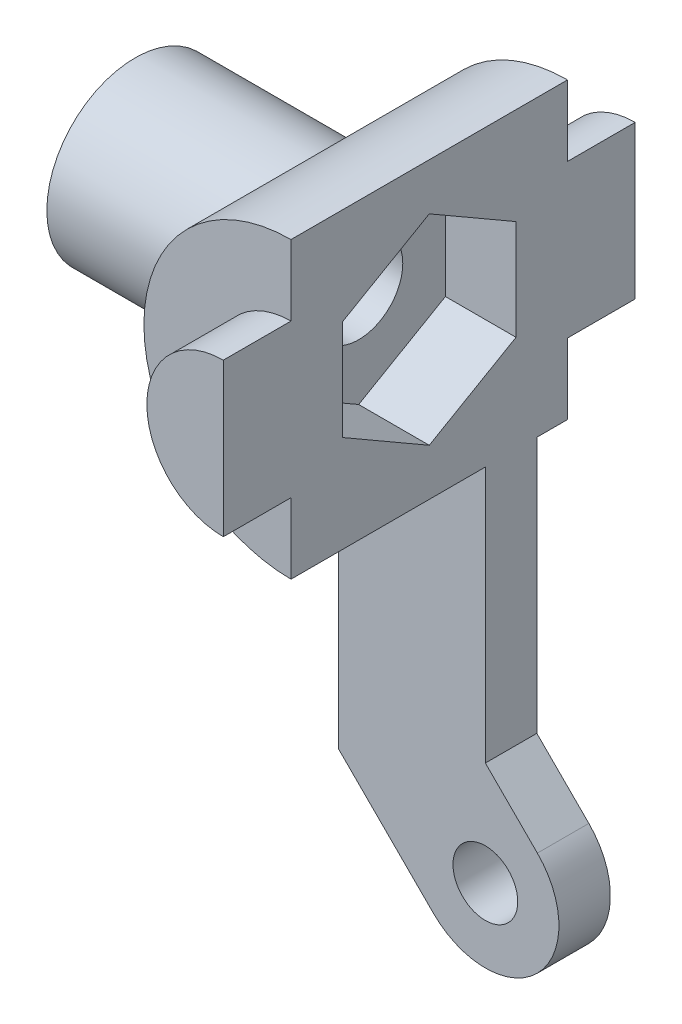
ISO-10303-21;
HEADER;
FILE_DESCRIPTION(('STEP AP214'),'2;1');
FILE_NAME('part.step','',(''),(''),'','','');
FILE_SCHEMA(('AUTOMOTIVE_DESIGN { 1 0 10303 214 1 1 1 1 }'));
ENDSEC;
DATA;
#1=APPLICATION_CONTEXT('core data for automotive mechanical design processes');
#2=APPLICATION_PROTOCOL_DEFINITION('international standard','automotive_design',2000,#1);
#3=PRODUCT_CONTEXT('',#1,'mechanical');
#4=PRODUCT('Part','Part','',(#3));
#5=PRODUCT_RELATED_PRODUCT_CATEGORY('part','',(#4));
#6=PRODUCT_DEFINITION_FORMATION('','',#4);
#7=PRODUCT_DEFINITION_CONTEXT('part definition',#1,'design');
#8=PRODUCT_DEFINITION('design','',#6,#7);
#9=PRODUCT_DEFINITION_SHAPE('','',#8);
#10=(LENGTH_UNIT() NAMED_UNIT(*) SI_UNIT(.MILLI.,.METRE.));
#11=(NAMED_UNIT(*) PLANE_ANGLE_UNIT() SI_UNIT($,.RADIAN.));
#12=(NAMED_UNIT(*) SI_UNIT($,.STERADIAN.) SOLID_ANGLE_UNIT());
#13=UNCERTAINTY_MEASURE_WITH_UNIT(LENGTH_MEASURE(1.E-05),#10,'distance_accuracy_value','');
#14=(GEOMETRIC_REPRESENTATION_CONTEXT(3) GLOBAL_UNCERTAINTY_ASSIGNED_CONTEXT((#13)) GLOBAL_UNIT_ASSIGNED_CONTEXT((#10,
#11,#12)) REPRESENTATION_CONTEXT('',''));
#15=CARTESIAN_POINT('',(0.,0.,0.));
#16=DIRECTION('',(0.,0.,1.));
#17=DIRECTION('',(1.,0.,0.));
#18=AXIS2_PLACEMENT_3D('',#15,#16,#17);
#19=CARTESIAN_POINT('',(-28.5875999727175,51.1546126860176,-10.));
#20=DIRECTION('',(0.,0.,1.));
#21=DIRECTION('',(-1.,0.,0.));
#22=AXIS2_PLACEMENT_3D('',#19,#20,#21);
#23=CYLINDRICAL_SURFACE('',#22,5.);
#24=CARTESIAN_POINT('',(-28.5875999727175,51.1546126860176,-9.7));
#25=DIRECTION('',(0.,0.,1.));
#26=DIRECTION('',(1.,0.,0.));
#27=AXIS2_PLACEMENT_3D('',#24,#25,#26);
#28=CIRCLE('',#27,5.);
#29=CARTESIAN_POINT('',(-28.5875999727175,56.1546126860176,-9.7));
#30=VERTEX_POINT('',#29);
#31=CARTESIAN_POINT('',(-28.5875999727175,46.1546126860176,-9.7));
#32=VERTEX_POINT('',#31);
#33=EDGE_CURVE('E204',#30,#32,#28,.T.);
#34=ORIENTED_EDGE('',*,*,#33,.T.);
#35=DIRECTION('',(0.,0.,1.));
#36=VECTOR('',#35,1.);
#37=CARTESIAN_POINT('',(-28.5875999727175,46.1546126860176,-10.));
#38=LINE('',#37,#36);
#39=CARTESIAN_POINT('',(-28.5875999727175,46.1546126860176,-8.65757331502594));
#40=VERTEX_POINT('',#39);
#41=EDGE_CURVE('E192',#32,#40,#38,.T.);
#42=ORIENTED_EDGE('',*,*,#41,.T.);
#43=CARTESIAN_POINT('',(-28.5875999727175,51.1546126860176,-8.65757331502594));
#44=DIRECTION('',(0.,0.,1.));
#45=DIRECTION('',(1.,0.,0.));
#46=AXIS2_PLACEMENT_3D('',#43,#44,#45);
#47=CIRCLE('',#46,5.);
#48=CARTESIAN_POINT('',(-33.5875999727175,51.1546126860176,-8.65757331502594));
#49=VERTEX_POINT('',#48);
#50=EDGE_CURVE('E224',#40,#49,#47,.F.);
#51=ORIENTED_EDGE('',*,*,#50,.T.);
#52=DIRECTION('',(0.,0.,1.));
#53=VECTOR('',#52,1.);
#54=CARTESIAN_POINT('',(-33.5875999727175,51.1546126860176,-32.3990574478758));
#55=LINE('',#54,#53);
#56=CARTESIAN_POINT('',(-33.5875999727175,51.1546126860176,-8.));
#57=VERTEX_POINT('',#56);
#58=EDGE_CURVE('E229',#49,#57,#55,.T.);
#59=ORIENTED_EDGE('',*,*,#58,.T.);
#60=CARTESIAN_POINT('',(-33.5875999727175,51.1546126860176,-2.));
#61=CARTESIAN_POINT('',(-33.5875990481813,51.2313824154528,-2.00000105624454));
#62=CARTESIAN_POINT('',(-33.5858256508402,51.308174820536,-2.00295359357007));
#63=CARTESIAN_POINT('',(-33.5787835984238,51.4611611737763,-2.01471423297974));
#64=CARTESIAN_POINT('',(-33.573512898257,51.5373547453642,-2.02352576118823));
#65=CARTESIAN_POINT('',(-33.5525934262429,51.7644208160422,-2.05864855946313));
#66=CARTESIAN_POINT('',(-33.5318376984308,51.9135945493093,-2.09364770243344));
#67=CARTESIAN_POINT('',(-33.4788323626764,52.2021543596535,-2.18477274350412));
#68=CARTESIAN_POINT('',(-33.4466397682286,52.341584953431,-2.24079392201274));
#69=CARTESIAN_POINT('',(-33.3735069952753,52.6086631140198,-2.37172066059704));
#70=CARTESIAN_POINT('',(-33.3325689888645,52.7363135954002,-2.44662153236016));
#71=CARTESIAN_POINT('',(-33.2417072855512,52.9872142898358,-2.61954965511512));
#72=CARTESIAN_POINT('',(-33.1913358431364,53.1093815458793,-2.71890739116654));
#73=CARTESIAN_POINT('',(-33.0882087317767,53.3363772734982,-2.93493440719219));
#74=CARTESIAN_POINT('',(-33.0354500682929,53.4411831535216,-3.05162587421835));
#75=CARTESIAN_POINT('',(-32.9258213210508,53.643512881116,-3.31584702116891));
#76=CARTESIAN_POINT('',(-32.8692403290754,53.738568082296,-3.46540354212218));
#77=CARTESIAN_POINT('',(-32.7663659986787,53.9018413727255,-3.78169314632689));
#78=CARTESIAN_POINT('',(-32.7200560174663,53.9701030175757,-3.94839779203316));
#79=CARTESIAN_POINT('',(-32.6546925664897,54.0634247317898,-4.2531929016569));
#80=CARTESIAN_POINT('',(-32.6317576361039,54.094936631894,-4.38847199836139));
#81=CARTESIAN_POINT('',(-32.5994061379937,54.1389361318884,-4.66360743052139));
#82=CARTESIAN_POINT('',(-32.5899727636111,54.1514473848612,-4.80345785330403));
#83=CARTESIAN_POINT('',(-32.58601842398,54.1567228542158,-5.08402299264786));
#84=CARTESIAN_POINT('',(-32.5915267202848,54.1494483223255,-5.22473886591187));
#85=CARTESIAN_POINT('',(-32.6166651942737,54.1155339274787,-5.50255753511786));
#86=CARTESIAN_POINT('',(-32.6363059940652,54.088879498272,-5.63965753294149));
#87=CARTESIAN_POINT('',(-32.6866637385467,54.0180910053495,-5.90506054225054));
#88=CARTESIAN_POINT('',(-32.7172343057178,53.9741872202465,-6.03345432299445));
#89=CARTESIAN_POINT('',(-32.7861408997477,53.8705143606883,-6.2813897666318));
#90=CARTESIAN_POINT('',(-32.8244797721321,53.8107394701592,-6.40092816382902));
#91=CARTESIAN_POINT('',(-32.9127069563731,53.6649704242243,-6.64996913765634));
#92=CARTESIAN_POINT('',(-32.963442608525,53.5762194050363,-6.77755999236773));
#93=CARTESIAN_POINT('',(-33.066210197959,53.3804423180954,-7.01734915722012));
#94=CARTESIAN_POINT('',(-33.118243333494,53.2733987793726,-7.12953256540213));
#95=CARTESIAN_POINT('',(-33.2263176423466,53.0262030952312,-7.35124225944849));
#96=CARTESIAN_POINT('',(-33.2819067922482,52.8835158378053,-7.45821939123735));
#97=CARTESIAN_POINT('',(-33.3577832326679,52.6552232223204,-7.59926871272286));
#98=CARTESIAN_POINT('',(-33.3818331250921,52.5767109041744,-7.6430641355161));
#99=CARTESIAN_POINT('',(-33.4267649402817,52.4153563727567,-7.723718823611));
#100=CARTESIAN_POINT('',(-33.4476488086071,52.3325168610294,-7.7605823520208));
#101=CARTESIAN_POINT('',(-33.4844267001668,52.1683763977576,-7.82481144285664));
#102=CARTESIAN_POINT('',(-33.500550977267,52.0873027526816,-7.85262656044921));
#103=CARTESIAN_POINT('',(-33.5289912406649,51.9224926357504,-7.90133395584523));
#104=CARTESIAN_POINT('',(-33.5413093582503,51.8387576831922,-7.92223010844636));
#105=CARTESIAN_POINT('',(-33.5617636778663,51.669357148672,-7.95677185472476));
#106=CARTESIAN_POINT('',(-33.5699029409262,51.5836930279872,-7.97042275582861));
#107=CARTESIAN_POINT('',(-33.5817599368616,51.4112344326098,-7.99026618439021));
#108=CARTESIAN_POINT('',(-33.5854782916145,51.3244401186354,-7.99645976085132));
#109=CARTESIAN_POINT('',(-33.5893915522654,51.087288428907,-8.00299267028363));
#110=CARTESIAN_POINT('',(-33.5850650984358,50.9365558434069,-7.9958115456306));
#111=CARTESIAN_POINT('',(-33.5631795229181,50.6389257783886,-7.9591544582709));
#112=CARTESIAN_POINT('',(-33.5456206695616,50.4920282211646,-7.92967894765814));
#113=CARTESIAN_POINT('',(-33.4994944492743,50.2094700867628,-7.85091154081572));
#114=CARTESIAN_POINT('',(-33.4712051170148,50.0736231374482,-7.80211887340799));
#115=CARTESIAN_POINT('',(-33.4058779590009,49.8120792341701,-7.6866456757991));
#116=CARTESIAN_POINT('',(-33.3688384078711,49.6863842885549,-7.61996161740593));
#117=CARTESIAN_POINT('',(-33.2845097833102,49.4346007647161,-7.46288590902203));
#118=CARTESIAN_POINT('',(-33.236555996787,49.3098245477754,-7.37075230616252));
#119=CARTESIAN_POINT('',(-33.1370853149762,49.0765604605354,-7.16921724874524));
#120=CARTESIAN_POINT('',(-33.0855643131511,48.968091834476,-7.05979570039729));
#121=CARTESIAN_POINT('',(-32.9765084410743,48.755972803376,-6.81017920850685));
#122=CARTESIAN_POINT('',(-32.919064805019,48.6547923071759,-6.66783222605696));
#123=CARTESIAN_POINT('',(-32.8119236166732,48.4777078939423,-6.36556795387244));
#124=CARTESIAN_POINT('',(-32.7622179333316,48.401777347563,-6.20566941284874));
#125=CARTESIAN_POINT('',(-32.6872981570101,48.2917611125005,-5.90751395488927));
#126=CARTESIAN_POINT('',(-32.6591131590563,48.2521801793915,-5.77203937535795));
#127=CARTESIAN_POINT('',(-32.6157920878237,48.1923394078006,-5.49493584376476));
#128=CARTESIAN_POINT('',(-32.6006379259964,48.1720527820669,-5.35331571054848));
#129=CARTESIAN_POINT('',(-32.5856089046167,48.1519300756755,-5.06724610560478));
#130=CARTESIAN_POINT('',(-32.5857915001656,48.1521708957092,-4.9227880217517));
#131=CARTESIAN_POINT('',(-32.6015543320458,48.1732832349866,-4.6362111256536));
#132=CARTESIAN_POINT('',(-32.6171429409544,48.1941659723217,-4.49409362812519));
#133=CARTESIAN_POINT('',(-32.6602636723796,48.2538091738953,-4.2230231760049));
#134=CARTESIAN_POINT('',(-32.6871841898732,48.2916598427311,-4.09376585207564));
#135=CARTESIAN_POINT('',(-32.7497100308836,48.3833479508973,-3.84332545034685));
#136=CARTESIAN_POINT('',(-32.7853186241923,48.4371914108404,-3.72214543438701));
#137=CARTESIAN_POINT('',(-32.8678597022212,48.5688273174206,-3.47136046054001));
#138=CARTESIAN_POINT('',(-32.9156913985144,48.6490275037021,-3.34331849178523));
#139=CARTESIAN_POINT('',(-33.014002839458,48.827100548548,-3.10123915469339));
#140=CARTESIAN_POINT('',(-33.0644847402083,48.9249879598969,-2.98721344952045));
#141=CARTESIAN_POINT('',(-33.1721123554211,49.1544091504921,-2.75730115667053));
#142=CARTESIAN_POINT('',(-33.2290004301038,49.2888269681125,-2.64415012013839));
#143=CARTESIAN_POINT('',(-33.334914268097,49.5777199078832,-2.44179201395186));
#144=CARTESIAN_POINT('',(-33.3839372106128,49.7322021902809,-2.35259352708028));
#145=CARTESIAN_POINT('',(-33.4468055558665,49.9735907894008,-2.24087552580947));
#146=CARTESIAN_POINT('',(-33.4657713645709,50.0543625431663,-2.2076640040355));
#147=CARTESIAN_POINT('',(-33.5000341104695,50.2191704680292,-2.14822786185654));
#148=CARTESIAN_POINT('',(-33.5153331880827,50.3032047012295,-2.12199916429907));
#149=CARTESIAN_POINT('',(-33.5417552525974,50.473610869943,-2.07699055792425));
#150=CARTESIAN_POINT('',(-33.552890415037,50.5599751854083,-2.05818892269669));
#151=CARTESIAN_POINT('',(-33.57068315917,50.7344289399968,-2.02825564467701));
#152=CARTESIAN_POINT('',(-33.5773444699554,50.8225168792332,-2.01711761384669));
#153=CARTESIAN_POINT('',(-33.5836372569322,50.9514887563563,-2.00660831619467));
#154=CARTESIAN_POINT('',(-33.5851219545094,50.9920564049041,-2.004131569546));
#155=CARTESIAN_POINT('',(-33.5871035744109,51.0732848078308,-2.00082710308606));
#156=CARTESIAN_POINT('',(-33.5876004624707,51.1139455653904,-1.99999944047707));
#157=CARTESIAN_POINT('',(-33.5875999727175,51.1546126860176,-2.));
#158=B_SPLINE_CURVE_WITH_KNOTS('',3,(#60,#61,#62,#63,#64,#65,#66,#67,#68,#69,#70,#71,#72,#73,
#74,#75,#76,#77,#78,#79,#80,#81,#82,#83,#84,#85,#86,#87,#88,#89,#90,#91,#92,#93,#94,#95,#96,#97,
#98,#99,#100,#101,#102,#103,#104,#105,#106,#107,#108,#109,#110,#111,#112,#113,#114,#115,#116,
#117,#118,#119,#120,#121,#122,#123,#124,#125,#126,#127,#128,#129,#130,#131,#132,#133,#134,#135,
#136,#137,#138,#139,#140,#141,#142,#143,#144,#145,#146,#147,#148,#149,#150,#151,#152,#153,#154,
#155,#156,#157),.UNSPECIFIED.,.T.,.F.,(4,2,2,2,2,2,2,2,2,2,2,2,2,2,2,2,2,2,2,2,2,2,2,2,2,2,2,2,
2,2,2,2,2,2,2,2,2,2,2,2,2,2,2,2,2,2,2,2,4),(0.,0.230263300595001,0.460661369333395,
0.922002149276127,1.38107466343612,1.84003329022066,2.33408870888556,2.82878205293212,
3.38413315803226,3.93857770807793,4.35913349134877,4.77916531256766,5.20002031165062,
5.62119195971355,6.03692224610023,6.45280509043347,6.94139679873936,7.43045779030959,
7.98767605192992,8.26653157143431,8.54521503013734,8.80648473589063,9.06760787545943,
9.3285394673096,9.58943435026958,10.0398406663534,10.490237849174,10.9296843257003,
11.3692175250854,11.8543559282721,12.3400624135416,12.889063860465,13.437484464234,
13.8674843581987,14.2968863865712,14.7278971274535,15.1591422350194,15.5696105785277,
15.9802336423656,16.4539008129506,16.927959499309,17.4794148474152,18.0310675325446,
18.2988384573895,18.5664526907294,18.8332781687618,19.0998809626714,19.221853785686,
19.3438308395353),.UNSPECIFIED.);
#159=CARTESIAN_POINT('',(-33.0191726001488,48.8391939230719,-6.90757331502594));
#160=VERTEX_POINT('',#159);
#161=EDGE_CURVE('E181',#160,#57,#158,.T.);
#162=ORIENTED_EDGE('',*,*,#161,.F.);
#163=CARTESIAN_POINT('',(-28.5875999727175,51.1546126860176,-6.90757331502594));
#164=DIRECTION('',(0.,0.,-1.));
#165=DIRECTION('',(-1.,0.,0.));
#166=AXIS2_PLACEMENT_3D('',#163,#164,#165);
#167=CIRCLE('',#166,5.);
#168=CARTESIAN_POINT('',(-28.5875999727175,46.1546126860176,-6.90757331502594));
#169=VERTEX_POINT('',#168);
#170=EDGE_CURVE('E262',#169,#160,#167,.T.);
#171=ORIENTED_EDGE('',*,*,#170,.F.);
#172=CARTESIAN_POINT('',(-28.5875999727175,46.1546126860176,-0.3));
#173=VERTEX_POINT('',#172);
#174=EDGE_CURVE('E183',#169,#173,#38,.T.);
#175=ORIENTED_EDGE('',*,*,#174,.T.);
#176=CARTESIAN_POINT('',(-28.5875999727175,51.1546126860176,-0.3));
#177=DIRECTION('',(0.,0.,1.));
#178=DIRECTION('',(1.,0.,0.));
#179=AXIS2_PLACEMENT_3D('',#176,#177,#178);
#180=CIRCLE('',#179,5.);
#181=CARTESIAN_POINT('',(-28.5875999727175,56.1546126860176,-0.3));
#182=VERTEX_POINT('',#181);
#183=EDGE_CURVE('E278',#182,#173,#180,.T.);
#184=ORIENTED_EDGE('',*,*,#183,.F.);
#185=DIRECTION('',(0.,0.,1.));
#186=VECTOR('',#185,1.);
#187=CARTESIAN_POINT('',(-28.5875999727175,56.1546126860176,-10.));
#188=LINE('',#187,#186);
#189=EDGE_CURVE('E180',#30,#182,#188,.T.);
#190=ORIENTED_EDGE('',*,*,#189,.F.);
#191=EDGE_LOOP('',(#34,#42,#51,#59,#162,#171,#175,#184,#190));
#192=FACE_BOUND('',#191,.T.);
#193=ADVANCED_FACE('F33',(#192),#23,.T.);
#194=CARTESIAN_POINT('',(-28.5875999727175,56.1546126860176,-10.));
#195=DIRECTION('',(-1.,0.,0.));
#196=DIRECTION('',(0.,0.,-1.));
#197=AXIS2_PLACEMENT_3D('',#194,#195,#196);
#198=PLANE('',#197);
#199=DIRECTION('',(0.,0.500000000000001,-0.866025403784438));
#200=VECTOR('',#199,1.);
#201=CARTESIAN_POINT('',(-28.5875999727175,47.7482460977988,-5.));
#202=LINE('',#201,#200);
#203=CARTESIAN_POINT('',(-28.5875999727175,47.7482460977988,-5.));
#204=VERTEX_POINT('',#203);
#205=CARTESIAN_POINT('',(-28.5875999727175,49.4514293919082,-7.95000000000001));
#206=VERTEX_POINT('',#205);
#207=EDGE_CURVE('E297',#204,#206,#202,.T.);
#208=ORIENTED_EDGE('',*,*,#207,.F.);
#209=DIRECTION('',(0.,-0.500000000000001,-0.866025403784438));
#210=VECTOR('',#209,1.);
#211=CARTESIAN_POINT('',(-28.5875999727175,49.4514293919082,-2.05));
#212=LINE('',#211,#210);
#213=CARTESIAN_POINT('',(-28.5875999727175,49.4514293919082,-2.05));
#214=VERTEX_POINT('',#213);
#215=EDGE_CURVE('E300',#214,#204,#212,.T.);
#216=ORIENTED_EDGE('',*,*,#215,.F.);
#217=DIRECTION('',(0.,-1.,0.));
#218=VECTOR('',#217,1.);
#219=CARTESIAN_POINT('',(-28.5875999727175,52.857795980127,-2.05));
#220=LINE('',#219,#218);
#221=CARTESIAN_POINT('',(-28.5875999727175,52.857795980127,-2.05));
#222=VERTEX_POINT('',#221);
#223=EDGE_CURVE('E287',#222,#214,#220,.T.);
#224=ORIENTED_EDGE('',*,*,#223,.F.);
#225=DIRECTION('',(0.,-0.500000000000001,0.866025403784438));
#226=VECTOR('',#225,1.);
#227=CARTESIAN_POINT('',(-28.5875999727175,54.5609792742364,-5.));
#228=LINE('',#227,#226);
#229=CARTESIAN_POINT('',(-28.5875999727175,54.5609792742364,-5.));
#230=VERTEX_POINT('',#229);
#231=EDGE_CURVE('E288',#230,#222,#228,.T.);
#232=ORIENTED_EDGE('',*,*,#231,.F.);
#233=DIRECTION('',(0.,0.500000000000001,0.866025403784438));
#234=VECTOR('',#233,1.);
#235=CARTESIAN_POINT('',(-28.5875999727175,52.857795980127,-7.95000000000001));
#236=LINE('',#235,#234);
#237=CARTESIAN_POINT('',(-28.5875999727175,52.857795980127,-7.95000000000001));
#238=VERTEX_POINT('',#237);
#239=EDGE_CURVE('E291',#238,#230,#236,.T.);
#240=ORIENTED_EDGE('',*,*,#239,.F.);
#241=DIRECTION('',(0.,1.,0.));
#242=VECTOR('',#241,1.);
#243=CARTESIAN_POINT('',(-28.5875999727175,49.4514293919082,-7.95000000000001));
#244=LINE('',#243,#242);
#245=EDGE_CURVE('E294',#206,#238,#244,.T.);
#246=ORIENTED_EDGE('',*,*,#245,.F.);
#247=EDGE_LOOP('',(#208,#216,#224,#232,#240,#246));
#248=FACE_BOUND('',#247,.T.);
#249=DIRECTION('',(0.,0.,1.));
#250=VECTOR('',#249,1.);
#251=CARTESIAN_POINT('',(-28.5875999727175,53.7546126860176,4.5503620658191));
#252=LINE('',#251,#250);
#253=CARTESIAN_POINT('',(-28.5875999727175,53.7546126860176,-9.7));
#254=VERTEX_POINT('',#253);
#255=CARTESIAN_POINT('',(-28.5875999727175,53.7546126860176,-12.));
#256=VERTEX_POINT('',#255);
#257=EDGE_CURVE('E48',#254,#256,#252,.F.);
#258=ORIENTED_EDGE('',*,*,#257,.F.);
#259=DIRECTION('',(0.,-1.,0.));
#260=VECTOR('',#259,1.);
#261=CARTESIAN_POINT('',(-28.5875999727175,56.1546126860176,-9.7));
#262=LINE('',#261,#260);
#263=EDGE_CURVE('E11',#30,#254,#262,.T.);
#264=ORIENTED_EDGE('',*,*,#263,.F.);
#265=ORIENTED_EDGE('',*,*,#189,.T.);
#266=DIRECTION('',(0.,1.,0.));
#267=VECTOR('',#266,1.);
#268=CARTESIAN_POINT('',(-28.5875999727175,56.1546126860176,-0.3));
#269=LINE('',#268,#267);
#270=CARTESIAN_POINT('',(-28.5875999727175,53.7546126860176,-0.3));
#271=VERTEX_POINT('',#270);
#272=EDGE_CURVE('E193',#271,#182,#269,.T.);
#273=ORIENTED_EDGE('',*,*,#272,.F.);
#274=DIRECTION('',(0.,0.,1.));
#275=VECTOR('',#274,1.);
#276=CARTESIAN_POINT('',(-28.5875999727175,53.7546126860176,4.5503620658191));
#277=LINE('',#276,#275);
#278=CARTESIAN_POINT('',(-28.5875999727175,53.7546126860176,2.));
#279=VERTEX_POINT('',#278);
#280=EDGE_CURVE('E279',#279,#271,#277,.F.);
#281=ORIENTED_EDGE('',*,*,#280,.F.);
#282=DIRECTION('',(0.,-1.,0.));
#283=VECTOR('',#282,1.);
#284=CARTESIAN_POINT('',(-28.5875999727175,54.1546126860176,2.));
#285=LINE('',#284,#283);
#286=CARTESIAN_POINT('',(-28.5875999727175,48.5546126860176,2.));
#287=VERTEX_POINT('',#286);
#288=EDGE_CURVE('E336',#279,#287,#285,.T.);
#289=ORIENTED_EDGE('',*,*,#288,.T.);
#290=DIRECTION('',(0.,0.,1.));
#291=VECTOR('',#290,1.);
#292=CARTESIAN_POINT('',(-28.5875999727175,48.5546126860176,4.5503620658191));
#293=LINE('',#292,#291);
#294=CARTESIAN_POINT('',(-28.5875999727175,48.5546126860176,-0.3));
#295=VERTEX_POINT('',#294);
#296=EDGE_CURVE('E56',#295,#287,#293,.T.);
#297=ORIENTED_EDGE('',*,*,#296,.F.);
#298=EDGE_CURVE('E195',#173,#295,#269,.T.);
#299=ORIENTED_EDGE('',*,*,#298,.F.);
#300=ORIENTED_EDGE('',*,*,#174,.F.);
#301=DIRECTION('',(0.,1.,0.));
#302=VECTOR('',#301,1.);
#303=CARTESIAN_POINT('',(-28.5875999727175,46.1546126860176,-6.90757331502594));
#304=LINE('',#303,#302);
#305=CARTESIAN_POINT('',(-28.5875999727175,37.4386319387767,-6.90757331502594));
#306=VERTEX_POINT('',#305);
#307=EDGE_CURVE('E232',#306,#169,#304,.T.);
#308=ORIENTED_EDGE('',*,*,#307,.F.);
#309=DIRECTION('',(0.,0.,-1.));
#310=VECTOR('',#309,1.);
#311=CARTESIAN_POINT('',(-28.5875999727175,37.4386319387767,2.71935088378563));
#312=LINE('',#311,#310);
#313=CARTESIAN_POINT('',(-28.5875999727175,37.4386319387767,-8.65757331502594));
#314=VERTEX_POINT('',#313);
#315=EDGE_CURVE('E217',#306,#314,#312,.T.);
#316=ORIENTED_EDGE('',*,*,#315,.T.);
#317=DIRECTION('',(0.,1.,0.));
#318=VECTOR('',#317,1.);
#319=CARTESIAN_POINT('',(-28.5875999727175,41.21771796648,-8.65757331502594));
#320=LINE('',#319,#318);
#321=EDGE_CURVE('E213',#314,#40,#320,.T.);
#322=ORIENTED_EDGE('',*,*,#321,.T.);
#323=ORIENTED_EDGE('',*,*,#41,.F.);
#324=CARTESIAN_POINT('',(-28.5875999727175,48.5546126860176,-9.7));
#325=VERTEX_POINT('',#324);
#326=EDGE_CURVE('E37',#325,#32,#262,.T.);
#327=ORIENTED_EDGE('',*,*,#326,.F.);
#328=DIRECTION('',(0.,0.,1.));
#329=VECTOR('',#328,1.);
#330=CARTESIAN_POINT('',(-28.5875999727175,48.5546126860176,4.5503620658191));
#331=LINE('',#330,#329);
#332=CARTESIAN_POINT('',(-28.5875999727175,48.5546126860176,-12.));
#333=VERTEX_POINT('',#332);
#334=EDGE_CURVE('E165',#333,#325,#331,.T.);
#335=ORIENTED_EDGE('',*,*,#334,.F.);
#336=DIRECTION('',(0.,1.,0.));
#337=VECTOR('',#336,1.);
#338=CARTESIAN_POINT('',(-28.5875999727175,54.1546126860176,-12.));
#339=LINE('',#338,#337);
#340=EDGE_CURVE('E175',#333,#256,#339,.T.);
#341=ORIENTED_EDGE('',*,*,#340,.T.);
#342=EDGE_LOOP('',(#258,#264,#265,#273,#281,#289,#297,#299,#300,#308,#316,#322,#323,#327,#335,#341));
#343=FACE_BOUND('',#342,.T.);
#344=ADVANCED_FACE('F174',(#248,#343),#198,.F.);
#345=CARTESIAN_POINT('',(-28.5875999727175,51.1546126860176,-12.));
#346=DIRECTION('',(0.,0.,-1.));
#347=DIRECTION('',(1.,0.,0.));
#348=AXIS2_PLACEMENT_3D('',#345,#346,#347);
#349=PLANE('',#348);
#350=ORIENTED_EDGE('',*,*,#340,.F.);
#351=CARTESIAN_POINT('',(-28.5875999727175,51.1546126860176,-12.));
#352=DIRECTION('',(0.,0.,1.));
#353=DIRECTION('',(1.,0.,0.));
#354=AXIS2_PLACEMENT_3D('',#351,#352,#353);
#355=CIRCLE('',#354,2.60000000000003);
#356=EDGE_CURVE('E162',#256,#333,#355,.T.);
#357=ORIENTED_EDGE('',*,*,#356,.F.);
#358=EDGE_LOOP('',(#350,#357));
#359=FACE_BOUND('',#358,.T.);
#360=ADVANCED_FACE('F179',(#359),#349,.T.);
#361=CARTESIAN_POINT('',(-28.5875999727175,51.1546126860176,2.));
#362=DIRECTION('',(0.,0.,1.));
#363=DIRECTION('',(-1.,0.,0.));
#364=AXIS2_PLACEMENT_3D('',#361,#362,#363);
#365=PLANE('',#364);
#366=ORIENTED_EDGE('',*,*,#288,.F.);
#367=CARTESIAN_POINT('',(-28.5875999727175,51.1546126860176,2.));
#368=DIRECTION('',(0.,0.,1.));
#369=DIRECTION('',(1.,0.,0.));
#370=AXIS2_PLACEMENT_3D('',#367,#368,#369);
#371=CIRCLE('',#370,2.60000000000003);
#372=EDGE_CURVE('E177',#279,#287,#371,.T.);
#373=ORIENTED_EDGE('',*,*,#372,.T.);
#374=EDGE_LOOP('',(#366,#373));
#375=FACE_BOUND('',#374,.T.);
#376=ADVANCED_FACE('F383',(#375),#365,.T.);
#377=CARTESIAN_POINT('',(-22.3268901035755,37.627148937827,-6.90757331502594));
#378=DIRECTION('',(0.,0.,1.));
#379=DIRECTION('',(-1.,0.,0.));
#380=AXIS2_PLACEMENT_3D('',#377,#378,#379);
#381=PLANE('',#380);
#382=CARTESIAN_POINT('',(-28.5875999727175,33.903098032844,-6.90757331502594));
#383=DIRECTION('',(0.,0.,1.));
#384=DIRECTION('',(1.,0.,0.));
#385=AXIS2_PLACEMENT_3D('',#382,#383,#384);
#386=CIRCLE('',#385,1.1);
#387=CARTESIAN_POINT('',(-27.4875999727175,33.903098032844,-6.90757331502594));
#388=VERTEX_POINT('',#387);
#389=EDGE_CURVE('E209',#388,#388,#386,.F.);
#390=ORIENTED_EDGE('',*,*,#389,.T.);
#391=EDGE_LOOP('',(#390));
#392=FACE_BOUND('',#391,.T.);
#393=ORIENTED_EDGE('',*,*,#170,.T.);
#394=DIRECTION('',(-1.,0.,0.));
#395=VECTOR('',#394,1.);
#396=CARTESIAN_POINT('',(-23.5875999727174,48.8391939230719,-6.90757331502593));
#397=LINE('',#396,#395);
#398=CARTESIAN_POINT('',(-33.5875999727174,48.8391939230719,-6.90757331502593));
#399=VERTEX_POINT('',#398);
#400=EDGE_CURVE('E251',#160,#399,#397,.T.);
#401=ORIENTED_EDGE('',*,*,#400,.T.);
#402=DIRECTION('',(0.,-1.,0.));
#403=VECTOR('',#402,1.);
#404=CARTESIAN_POINT('',(-33.5875999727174,39.6440397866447,-6.90757331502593));
#405=LINE('',#404,#403);
#406=CARTESIAN_POINT('',(-33.5875999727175,35.3675641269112,-6.90757331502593));
#407=VERTEX_POINT('',#406);
#408=EDGE_CURVE('E257',#399,#407,#405,.T.);
#409=ORIENTED_EDGE('',*,*,#408,.T.);
#410=DIRECTION('',(-0.707106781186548,0.707106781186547,0.));
#411=VECTOR('',#410,1.);
#412=CARTESIAN_POINT('',(-33.5875999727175,35.3675641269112,-6.90757331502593));
#413=LINE('',#412,#411);
#414=CARTESIAN_POINT('',(-30.3553669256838,32.1353310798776,-6.90757331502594));
#415=VERTEX_POINT('',#414);
#416=EDGE_CURVE('E345',#415,#407,#413,.T.);
#417=ORIENTED_EDGE('',*,*,#416,.F.);
#418=CARTESIAN_POINT('',(-28.5875999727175,33.903098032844,-6.90757331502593));
#419=DIRECTION('',(0.,0.,-1.));
#420=DIRECTION('',(-1.,0.,0.));
#421=AXIS2_PLACEMENT_3D('',#418,#419,#420);
#422=CIRCLE('',#421,2.5);
#423=CARTESIAN_POINT('',(-26.8198330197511,35.6708649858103,-6.90757331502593));
#424=VERTEX_POINT('',#423);
#425=EDGE_CURVE('E352',#415,#424,#422,.F.);
#426=ORIENTED_EDGE('',*,*,#425,.T.);
#427=DIRECTION('',(-0.707106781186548,0.707106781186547,0.));
#428=VECTOR('',#427,1.);
#429=CARTESIAN_POINT('',(-26.8198330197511,35.6708649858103,-6.90757331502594));
#430=LINE('',#429,#428);
#431=EDGE_CURVE('E276',#424,#306,#430,.T.);
#432=ORIENTED_EDGE('',*,*,#431,.T.);
#433=ORIENTED_EDGE('',*,*,#307,.T.);
#434=EDGE_LOOP('',(#393,#401,#409,#417,#426,#432,#433));
#435=FACE_BOUND('',#434,.T.);
#436=ADVANCED_FACE('F273',(#392,#435),#381,.T.);
#437=CARTESIAN_POINT('',(-33.5875999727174,51.1546126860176,-5.));
#438=DIRECTION('',(1.,0.,0.));
#439=DIRECTION('',(0.,0.,1.));
#440=AXIS2_PLACEMENT_3D('',#437,#438,#439);
#441=PLANE('',#440);
#442=ORIENTED_EDGE('',*,*,#408,.F.);
#443=CARTESIAN_POINT('',(-33.5875999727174,51.1546126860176,-5.));
#444=DIRECTION('',(1.,0.,0.));
#445=DIRECTION('',(0.,0.,1.));
#446=AXIS2_PLACEMENT_3D('',#443,#444,#445);
#447=CIRCLE('',#446,3.);
#448=EDGE_CURVE('E220',#399,#57,#447,.T.);
#449=ORIENTED_EDGE('',*,*,#448,.T.);
#450=ORIENTED_EDGE('',*,*,#58,.F.);
#451=DIRECTION('',(0.,-1.,0.));
#452=VECTOR('',#451,1.);
#453=CARTESIAN_POINT('',(-33.5875999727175,51.1546126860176,-8.65757331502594));
#454=LINE('',#453,#452);
#455=CARTESIAN_POINT('',(-33.5875999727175,35.3675641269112,-8.65757331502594));
#456=VERTEX_POINT('',#455);
#457=EDGE_CURVE('E221',#49,#456,#454,.T.);
#458=ORIENTED_EDGE('',*,*,#457,.T.);
#459=DIRECTION('',(0.,0.,-1.));
#460=VECTOR('',#459,1.);
#461=CARTESIAN_POINT('',(-33.5875999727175,35.3675641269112,-1.4505144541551));
#462=LINE('',#461,#460);
#463=EDGE_CURVE('E259',#407,#456,#462,.T.);
#464=ORIENTED_EDGE('',*,*,#463,.F.);
#465=EDGE_LOOP('',(#442,#449,#450,#458,#464));
#466=FACE_BOUND('',#465,.T.);
#467=ADVANCED_FACE('F247',(#466),#441,.F.);
#468=CARTESIAN_POINT('',(-38.5875999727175,51.1546126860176,-5.));
#469=DIRECTION('',(1.,0.,0.));
#470=DIRECTION('',(0.,0.,1.));
#471=AXIS2_PLACEMENT_3D('',#468,#469,#470);
#472=CYLINDRICAL_SURFACE('',#471,3.);
#473=CARTESIAN_POINT('',(-38.5875999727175,51.1546126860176,-5.));
#474=DIRECTION('',(-1.,0.,0.));
#475=DIRECTION('',(0.,0.,1.));
#476=AXIS2_PLACEMENT_3D('',#473,#474,#475);
#477=CIRCLE('',#476,3.);
#478=CARTESIAN_POINT('',(-38.5875999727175,51.1546126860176,-2.));
#479=VERTEX_POINT('',#478);
#480=EDGE_CURVE('E185',#479,#479,#477,.T.);
#481=ORIENTED_EDGE('',*,*,#480,.F.);
#482=EDGE_LOOP('',(#481));
#483=FACE_BOUND('',#482,.T.);
#484=ORIENTED_EDGE('',*,*,#161,.T.);
#485=ORIENTED_EDGE('',*,*,#448,.F.);
#486=ORIENTED_EDGE('',*,*,#400,.F.);
#487=EDGE_LOOP('',(#484,#485,#486));
#488=FACE_BOUND('',#487,.T.);
#489=ADVANCED_FACE('F244',(#483,#488),#472,.T.);
#490=CARTESIAN_POINT('',(-38.5875999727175,51.1546126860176,-5.));
#491=DIRECTION('',(1.,0.,0.));
#492=DIRECTION('',(0.,0.,1.));
#493=AXIS2_PLACEMENT_3D('',#490,#491,#492);
#494=PLANE('',#493);
#495=CARTESIAN_POINT('',(-38.5875999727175,51.1546126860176,-5.));
#496=DIRECTION('',(1.,0.,0.));
#497=DIRECTION('',(0.,0.,-1.));
#498=AXIS2_PLACEMENT_3D('',#495,#496,#497);
#499=CIRCLE('',#498,1.5);
#500=CARTESIAN_POINT('',(-38.5875999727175,51.1546126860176,-6.5));
#501=VERTEX_POINT('',#500);
#502=EDGE_CURVE('E237',#501,#501,#499,.T.);
#503=ORIENTED_EDGE('',*,*,#502,.T.);
#504=EDGE_LOOP('',(#503));
#505=FACE_BOUND('',#504,.T.);
#506=ORIENTED_EDGE('',*,*,#480,.T.);
#507=EDGE_LOOP('',(#506));
#508=FACE_BOUND('',#507,.T.);
#509=ADVANCED_FACE('F242',(#505,#508),#494,.F.);
#510=CARTESIAN_POINT('',(-24.3449592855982,51.1546126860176,-5.));
#511=DIRECTION('',(-1.,0.,0.));
#512=DIRECTION('',(0.,0.,-1.));
#513=AXIS2_PLACEMENT_3D('',#510,#511,#512);
#514=CYLINDRICAL_SURFACE('',#513,1.5);
#515=CARTESIAN_POINT('',(-30.9875999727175,51.1546126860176,-5.));
#516=DIRECTION('',(-1.,0.,0.));
#517=DIRECTION('',(0.,-0.5,0.866025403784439));
#518=AXIS2_PLACEMENT_3D('',#515,#516,#517);
#519=CIRCLE('',#518,1.5);
#520=CARTESIAN_POINT('',(-30.9875999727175,50.4046126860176,-3.70096189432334));
#521=VERTEX_POINT('',#520);
#522=EDGE_CURVE('E339',#521,#521,#519,.T.);
#523=ORIENTED_EDGE('',*,*,#522,.F.);
#524=EDGE_LOOP('',(#523));
#525=FACE_BOUND('',#524,.T.);
#526=ORIENTED_EDGE('',*,*,#502,.F.);
#527=EDGE_LOOP('',(#526));
#528=FACE_BOUND('',#527,.T.);
#529=ADVANCED_FACE('F390',(#525,#528),#514,.F.);
#530=CARTESIAN_POINT('',(-22.3268901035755,37.627148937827,-8.65757331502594));
#531=DIRECTION('',(0.,0.,-1.));
#532=DIRECTION('',(1.,0.,0.));
#533=AXIS2_PLACEMENT_3D('',#530,#531,#532);
#534=PLANE('',#533);
#535=CARTESIAN_POINT('',(-28.5875999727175,33.903098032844,-8.65757331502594));
#536=DIRECTION('',(0.,0.,-1.));
#537=DIRECTION('',(-1.,0.,0.));
#538=AXIS2_PLACEMENT_3D('',#535,#536,#537);
#539=CIRCLE('',#538,1.1);
#540=CARTESIAN_POINT('',(-29.6875999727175,33.903098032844,-8.65757331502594));
#541=VERTEX_POINT('',#540);
#542=EDGE_CURVE('E670',#541,#541,#539,.T.);
#543=ORIENTED_EDGE('',*,*,#542,.F.);
#544=EDGE_LOOP('',(#543));
#545=FACE_BOUND('',#544,.T.);
#546=DIRECTION('',(-0.707106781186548,0.707106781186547,0.));
#547=VECTOR('',#546,1.);
#548=CARTESIAN_POINT('',(-33.5875999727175,35.3675641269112,-8.65757331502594));
#549=LINE('',#548,#547);
#550=CARTESIAN_POINT('',(-30.3553669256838,32.1353310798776,-8.65757331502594));
#551=VERTEX_POINT('',#550);
#552=EDGE_CURVE('E342',#551,#456,#549,.T.);
#553=ORIENTED_EDGE('',*,*,#552,.T.);
#554=ORIENTED_EDGE('',*,*,#457,.F.);
#555=ORIENTED_EDGE('',*,*,#50,.F.);
#556=ORIENTED_EDGE('',*,*,#321,.F.);
#557=DIRECTION('',(-0.707106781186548,0.707106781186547,0.));
#558=VECTOR('',#557,1.);
#559=CARTESIAN_POINT('',(-26.8198330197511,35.6708649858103,-8.65757331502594));
#560=LINE('',#559,#558);
#561=CARTESIAN_POINT('',(-26.8198330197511,35.6708649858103,-8.65757331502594));
#562=VERTEX_POINT('',#561);
#563=EDGE_CURVE('E263',#562,#314,#560,.T.);
#564=ORIENTED_EDGE('',*,*,#563,.F.);
#565=CARTESIAN_POINT('',(-28.5875999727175,33.903098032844,-8.65757331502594));
#566=DIRECTION('',(0.,0.,1.));
#567=DIRECTION('',(1.,0.,0.));
#568=AXIS2_PLACEMENT_3D('',#565,#566,#567);
#569=CIRCLE('',#568,2.5);
#570=EDGE_CURVE('E266',#551,#562,#569,.T.);
#571=ORIENTED_EDGE('',*,*,#570,.F.);
#572=EDGE_LOOP('',(#553,#554,#555,#556,#564,#571));
#573=FACE_BOUND('',#572,.T.);
#574=ADVANCED_FACE('F225',(#545,#573),#534,.T.);
#575=CARTESIAN_POINT('',(-26.8198330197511,35.6708649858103,2.71935088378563));
#576=DIRECTION('',(0.707106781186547,0.707106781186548,0.));
#577=DIRECTION('',(-0.707106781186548,0.707106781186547,0.));
#578=AXIS2_PLACEMENT_3D('',#575,#576,#577);
#579=PLANE('',#578);
#580=DIRECTION('',(0.,0.,-1.));
#581=VECTOR('',#580,1.);
#582=CARTESIAN_POINT('',(-26.8198330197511,35.6708649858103,2.71935088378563));
#583=LINE('',#582,#581);
#584=EDGE_CURVE('E269',#424,#562,#583,.T.);
#585=ORIENTED_EDGE('',*,*,#584,.T.);
#586=ORIENTED_EDGE('',*,*,#563,.T.);
#587=ORIENTED_EDGE('',*,*,#315,.F.);
#588=ORIENTED_EDGE('',*,*,#431,.F.);
#589=EDGE_LOOP('',(#585,#586,#587,#588));
#590=FACE_BOUND('',#589,.T.);
#591=ADVANCED_FACE('F355',(#590),#579,.T.);
#592=CARTESIAN_POINT('',(-28.5875999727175,33.903098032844,2.71935088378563));
#593=DIRECTION('',(0.,0.,-1.));
#594=DIRECTION('',(1.,0.,0.));
#595=AXIS2_PLACEMENT_3D('',#592,#593,#594);
#596=CYLINDRICAL_SURFACE('',#595,2.5);
#597=ORIENTED_EDGE('',*,*,#570,.T.);
#598=ORIENTED_EDGE('',*,*,#584,.F.);
#599=ORIENTED_EDGE('',*,*,#425,.F.);
#600=DIRECTION('',(0.,0.,-1.));
#601=VECTOR('',#600,1.);
#602=CARTESIAN_POINT('',(-30.3553669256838,32.1353310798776,-1.4505144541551));
#603=LINE('',#602,#601);
#604=EDGE_CURVE('E344',#415,#551,#603,.T.);
#605=ORIENTED_EDGE('',*,*,#604,.T.);
#606=EDGE_LOOP('',(#597,#598,#599,#605));
#607=FACE_BOUND('',#606,.T.);
#608=ADVANCED_FACE('F358',(#607),#596,.T.);
#609=CARTESIAN_POINT('',(-33.5875999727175,35.3675641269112,-1.4505144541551));
#610=DIRECTION('',(0.707106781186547,0.707106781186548,0.));
#611=DIRECTION('',(-0.707106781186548,0.707106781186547,0.));
#612=AXIS2_PLACEMENT_3D('',#609,#610,#611);
#613=PLANE('',#612);
#614=ORIENTED_EDGE('',*,*,#604,.F.);
#615=ORIENTED_EDGE('',*,*,#416,.T.);
#616=ORIENTED_EDGE('',*,*,#463,.T.);
#617=ORIENTED_EDGE('',*,*,#552,.F.);
#618=EDGE_LOOP('',(#614,#615,#616,#617));
#619=FACE_BOUND('',#618,.T.);
#620=ADVANCED_FACE('F361',(#619),#613,.F.);
#621=CARTESIAN_POINT('',(-30.9875999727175,51.1546126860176,-5.));
#622=DIRECTION('',(-1.,0.,0.));
#623=DIRECTION('',(0.,-0.866025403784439,-0.5));
#624=AXIS2_PLACEMENT_3D('',#621,#622,#623);
#625=PLANE('',#624);
#626=ORIENTED_EDGE('',*,*,#522,.T.);
#627=EDGE_LOOP('',(#626));
#628=FACE_BOUND('',#627,.T.);
#629=DIRECTION('',(0.,-1.,0.));
#630=VECTOR('',#629,1.);
#631=CARTESIAN_POINT('',(-30.9875999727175,52.857795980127,-2.05));
#632=LINE('',#631,#630);
#633=CARTESIAN_POINT('',(-30.9875999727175,52.857795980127,-2.05));
#634=VERTEX_POINT('',#633);
#635=CARTESIAN_POINT('',(-30.9875999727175,49.4514293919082,-2.05));
#636=VERTEX_POINT('',#635);
#637=EDGE_CURVE('E308',#634,#636,#632,.T.);
#638=ORIENTED_EDGE('',*,*,#637,.T.);
#639=DIRECTION('',(0.,-0.500000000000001,-0.866025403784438));
#640=VECTOR('',#639,1.);
#641=CARTESIAN_POINT('',(-30.9875999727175,49.4514293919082,-2.05));
#642=LINE('',#641,#640);
#643=CARTESIAN_POINT('',(-30.9875999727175,47.7482460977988,-5.));
#644=VERTEX_POINT('',#643);
#645=EDGE_CURVE('E290',#636,#644,#642,.T.);
#646=ORIENTED_EDGE('',*,*,#645,.T.);
#647=DIRECTION('',(0.,0.500000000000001,-0.866025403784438));
#648=VECTOR('',#647,1.);
#649=CARTESIAN_POINT('',(-30.9875999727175,47.7482460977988,-5.));
#650=LINE('',#649,#648);
#651=CARTESIAN_POINT('',(-30.9875999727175,49.4514293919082,-7.95000000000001));
#652=VERTEX_POINT('',#651);
#653=EDGE_CURVE('E325',#644,#652,#650,.T.);
#654=ORIENTED_EDGE('',*,*,#653,.T.);
#655=DIRECTION('',(0.,1.,0.));
#656=VECTOR('',#655,1.);
#657=CARTESIAN_POINT('',(-30.9875999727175,49.4514293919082,-7.95000000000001));
#658=LINE('',#657,#656);
#659=CARTESIAN_POINT('',(-30.9875999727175,52.857795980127,-7.95000000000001));
#660=VERTEX_POINT('',#659);
#661=EDGE_CURVE('E321',#652,#660,#658,.T.);
#662=ORIENTED_EDGE('',*,*,#661,.T.);
#663=DIRECTION('',(0.,0.500000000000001,0.866025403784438));
#664=VECTOR('',#663,1.);
#665=CARTESIAN_POINT('',(-30.9875999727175,52.857795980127,-7.95000000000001));
#666=LINE('',#665,#664);
#667=CARTESIAN_POINT('',(-30.9875999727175,54.5609792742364,-5.));
#668=VERTEX_POINT('',#667);
#669=EDGE_CURVE('E317',#660,#668,#666,.T.);
#670=ORIENTED_EDGE('',*,*,#669,.T.);
#671=DIRECTION('',(0.,-0.500000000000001,0.866025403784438));
#672=VECTOR('',#671,1.);
#673=CARTESIAN_POINT('',(-30.9875999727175,54.5609792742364,-5.));
#674=LINE('',#673,#672);
#675=EDGE_CURVE('E313',#668,#634,#674,.T.);
#676=ORIENTED_EDGE('',*,*,#675,.T.);
#677=EDGE_LOOP('',(#638,#646,#654,#662,#670,#676));
#678=FACE_BOUND('',#677,.T.);
#679=ADVANCED_FACE('F363',(#628,#678),#625,.F.);
#680=CARTESIAN_POINT('',(-39.9999988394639,49.4514293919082,-2.05));
#681=DIRECTION('',(0.,-0.866025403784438,0.500000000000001));
#682=DIRECTION('',(0.,-0.500000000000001,-0.866025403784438));
#683=AXIS2_PLACEMENT_3D('',#680,#681,#682);
#684=PLANE('',#683);
#685=DIRECTION('',(1.,0.,0.));
#686=VECTOR('',#685,1.);
#687=CARTESIAN_POINT('',(-39.9999988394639,49.4514293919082,-2.05));
#688=LINE('',#687,#686);
#689=EDGE_CURVE('E311',#636,#214,#688,.T.);
#690=ORIENTED_EDGE('',*,*,#689,.T.);
#691=ORIENTED_EDGE('',*,*,#215,.T.);
#692=DIRECTION('',(1.,0.,0.));
#693=VECTOR('',#692,1.);
#694=CARTESIAN_POINT('',(-39.9999988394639,47.7482460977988,-5.));
#695=LINE('',#694,#693);
#696=EDGE_CURVE('E307',#644,#204,#695,.T.);
#697=ORIENTED_EDGE('',*,*,#696,.F.);
#698=ORIENTED_EDGE('',*,*,#645,.F.);
#699=EDGE_LOOP('',(#690,#691,#697,#698));
#700=FACE_BOUND('',#699,.T.);
#701=ADVANCED_FACE('F370',(#700),#684,.F.);
#702=CARTESIAN_POINT('',(-39.9999988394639,47.7482460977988,-5.));
#703=DIRECTION('',(0.,-0.866025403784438,-0.500000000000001));
#704=DIRECTION('',(0.,0.500000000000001,-0.866025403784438));
#705=AXIS2_PLACEMENT_3D('',#702,#703,#704);
#706=PLANE('',#705);
#707=ORIENTED_EDGE('',*,*,#696,.T.);
#708=ORIENTED_EDGE('',*,*,#207,.T.);
#709=DIRECTION('',(1.,0.,0.));
#710=VECTOR('',#709,1.);
#711=CARTESIAN_POINT('',(-39.9999988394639,49.4514293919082,-7.95000000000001));
#712=LINE('',#711,#710);
#713=EDGE_CURVE('E324',#652,#206,#712,.T.);
#714=ORIENTED_EDGE('',*,*,#713,.F.);
#715=ORIENTED_EDGE('',*,*,#653,.F.);
#716=EDGE_LOOP('',(#707,#708,#714,#715));
#717=FACE_BOUND('',#716,.T.);
#718=ADVANCED_FACE('F531',(#717),#706,.F.);
#719=CARTESIAN_POINT('',(-39.9999988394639,49.4514293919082,-7.95000000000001));
#720=DIRECTION('',(0.,0.,-1.));
#721=DIRECTION('',(-1.,0.,0.));
#722=AXIS2_PLACEMENT_3D('',#719,#720,#721);
#723=PLANE('',#722);
#724=ORIENTED_EDGE('',*,*,#713,.T.);
#725=ORIENTED_EDGE('',*,*,#245,.T.);
#726=DIRECTION('',(1.,0.,0.));
#727=VECTOR('',#726,1.);
#728=CARTESIAN_POINT('',(-39.9999988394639,52.857795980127,-7.95000000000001));
#729=LINE('',#728,#727);
#730=EDGE_CURVE('E320',#660,#238,#729,.T.);
#731=ORIENTED_EDGE('',*,*,#730,.F.);
#732=ORIENTED_EDGE('',*,*,#661,.F.);
#733=EDGE_LOOP('',(#724,#725,#731,#732));
#734=FACE_BOUND('',#733,.T.);
#735=ADVANCED_FACE('F523',(#734),#723,.F.);
#736=CARTESIAN_POINT('',(-39.9999988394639,52.857795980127,-7.95000000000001));
#737=DIRECTION('',(0.,0.866025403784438,-0.500000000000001));
#738=DIRECTION('',(0.,0.500000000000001,0.866025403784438));
#739=AXIS2_PLACEMENT_3D('',#736,#737,#738);
#740=PLANE('',#739);
#741=ORIENTED_EDGE('',*,*,#730,.T.);
#742=ORIENTED_EDGE('',*,*,#239,.T.);
#743=DIRECTION('',(1.,0.,0.));
#744=VECTOR('',#743,1.);
#745=CARTESIAN_POINT('',(-39.9999988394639,54.5609792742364,-5.));
#746=LINE('',#745,#744);
#747=EDGE_CURVE('E316',#668,#230,#746,.T.);
#748=ORIENTED_EDGE('',*,*,#747,.F.);
#749=ORIENTED_EDGE('',*,*,#669,.F.);
#750=EDGE_LOOP('',(#741,#742,#748,#749));
#751=FACE_BOUND('',#750,.T.);
#752=ADVANCED_FACE('F515',(#751),#740,.F.);
#753=CARTESIAN_POINT('',(-39.9999988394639,54.5609792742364,-5.));
#754=DIRECTION('',(0.,0.866025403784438,0.500000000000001));
#755=DIRECTION('',(0.,-0.500000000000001,0.866025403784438));
#756=AXIS2_PLACEMENT_3D('',#753,#754,#755);
#757=PLANE('',#756);
#758=ORIENTED_EDGE('',*,*,#747,.T.);
#759=ORIENTED_EDGE('',*,*,#231,.T.);
#760=DIRECTION('',(1.,0.,0.));
#761=VECTOR('',#760,1.);
#762=CARTESIAN_POINT('',(-39.9999988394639,52.857795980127,-2.05));
#763=LINE('',#762,#761);
#764=EDGE_CURVE('E312',#634,#222,#763,.T.);
#765=ORIENTED_EDGE('',*,*,#764,.F.);
#766=ORIENTED_EDGE('',*,*,#675,.F.);
#767=EDGE_LOOP('',(#758,#759,#765,#766));
#768=FACE_BOUND('',#767,.T.);
#769=ADVANCED_FACE('F507',(#768),#757,.F.);
#770=CARTESIAN_POINT('',(-39.9999988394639,52.857795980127,-2.05));
#771=DIRECTION('',(0.,0.,1.));
#772=DIRECTION('',(1.,0.,0.));
#773=AXIS2_PLACEMENT_3D('',#770,#771,#772);
#774=PLANE('',#773);
#775=ORIENTED_EDGE('',*,*,#764,.T.);
#776=ORIENTED_EDGE('',*,*,#223,.T.);
#777=ORIENTED_EDGE('',*,*,#689,.F.);
#778=ORIENTED_EDGE('',*,*,#637,.F.);
#779=EDGE_LOOP('',(#775,#776,#777,#778));
#780=FACE_BOUND('',#779,.T.);
#781=ADVANCED_FACE('F500',(#780),#774,.F.);
#782=CARTESIAN_POINT('',(-28.5875999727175,56.1546126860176,-0.3));
#783=DIRECTION('',(0.,0.,1.));
#784=DIRECTION('',(1.,0.,0.));
#785=AXIS2_PLACEMENT_3D('',#782,#783,#784);
#786=PLANE('',#785);
#787=ORIENTED_EDGE('',*,*,#298,.T.);
#788=CARTESIAN_POINT('',(-28.5875999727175,51.1546126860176,-0.3));
#789=DIRECTION('',(0.,0.,1.));
#790=DIRECTION('',(1.,0.,0.));
#791=AXIS2_PLACEMENT_3D('',#788,#789,#790);
#792=CIRCLE('',#791,2.60000000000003);
#793=EDGE_CURVE('E280',#271,#295,#792,.T.);
#794=ORIENTED_EDGE('',*,*,#793,.F.);
#795=ORIENTED_EDGE('',*,*,#272,.T.);
#796=ORIENTED_EDGE('',*,*,#183,.T.);
#797=EDGE_LOOP('',(#787,#794,#795,#796));
#798=FACE_BOUND('',#797,.T.);
#799=ADVANCED_FACE('F493',(#798),#786,.T.);
#800=CARTESIAN_POINT('',(-28.5875999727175,51.1546126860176,4.5503620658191));
#801=DIRECTION('',(0.,0.,1.));
#802=DIRECTION('',(1.,0.,0.));
#803=AXIS2_PLACEMENT_3D('',#800,#801,#802);
#804=CYLINDRICAL_SURFACE('',#803,2.60000000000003);
#805=ORIENTED_EDGE('',*,*,#296,.T.);
#806=ORIENTED_EDGE('',*,*,#372,.F.);
#807=ORIENTED_EDGE('',*,*,#280,.T.);
#808=ORIENTED_EDGE('',*,*,#793,.T.);
#809=EDGE_LOOP('',(#805,#806,#807,#808));
#810=FACE_BOUND('',#809,.T.);
#811=ADVANCED_FACE('F486',(#810),#804,.T.);
#812=CARTESIAN_POINT('',(-28.5875999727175,53.7546126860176,-9.7));
#813=DIRECTION('',(0.,0.,-1.));
#814=DIRECTION('',(-1.,0.,0.));
#815=AXIS2_PLACEMENT_3D('',#812,#813,#814);
#816=PLANE('',#815);
#817=ORIENTED_EDGE('',*,*,#263,.T.);
#818=CARTESIAN_POINT('',(-28.5875999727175,51.1546126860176,-9.7));
#819=DIRECTION('',(0.,0.,1.));
#820=DIRECTION('',(1.,0.,0.));
#821=AXIS2_PLACEMENT_3D('',#818,#819,#820);
#822=CIRCLE('',#821,2.60000000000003);
#823=EDGE_CURVE('E170',#254,#325,#822,.T.);
#824=ORIENTED_EDGE('',*,*,#823,.T.);
#825=ORIENTED_EDGE('',*,*,#326,.T.);
#826=ORIENTED_EDGE('',*,*,#33,.F.);
#827=EDGE_LOOP('',(#817,#824,#825,#826));
#828=FACE_BOUND('',#827,.T.);
#829=ADVANCED_FACE('F203',(#828),#816,.T.);
#830=CARTESIAN_POINT('',(-28.5875999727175,51.1546126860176,4.5503620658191));
#831=DIRECTION('',(0.,0.,1.));
#832=DIRECTION('',(1.,0.,0.));
#833=AXIS2_PLACEMENT_3D('',#830,#831,#832);
#834=CYLINDRICAL_SURFACE('',#833,2.60000000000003);
#835=ORIENTED_EDGE('',*,*,#334,.T.);
#836=ORIENTED_EDGE('',*,*,#823,.F.);
#837=ORIENTED_EDGE('',*,*,#257,.T.);
#838=ORIENTED_EDGE('',*,*,#356,.T.);
#839=EDGE_LOOP('',(#835,#836,#837,#838));
#840=FACE_BOUND('',#839,.T.);
#841=ADVANCED_FACE('F164',(#840),#834,.T.);
#842=CARTESIAN_POINT('',(-28.5875999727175,33.903098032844,-3.79630347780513));
#843=DIRECTION('',(0.,0.,-1.));
#844=DIRECTION('',(-1.,0.,0.));
#845=AXIS2_PLACEMENT_3D('',#842,#843,#844);
#846=CYLINDRICAL_SURFACE('',#845,1.1);
#847=ORIENTED_EDGE('',*,*,#542,.T.);
#848=EDGE_LOOP('',(#847));
#849=FACE_BOUND('',#848,.T.);
#850=ORIENTED_EDGE('',*,*,#389,.F.);
#851=EDGE_LOOP('',(#850));
#852=FACE_BOUND('',#851,.T.);
#853=ADVANCED_FACE('F468',(#849,#852),#846,.F.);
#854=CLOSED_SHELL('',(#193,#344,#360,#376,#436,#467,#489,#509,#529,#574,#591,#608,#620,#679,
#701,#718,#735,#752,#769,#781,#799,#811,#829,#841,#853));
#855=MANIFOLD_SOLID_BREP('B2',#854);
#856=ADVANCED_BREP_SHAPE_REPRESENTATION('',(#18,#855),#14);
#857=SHAPE_DEFINITION_REPRESENTATION(#9,#856);
ENDSEC;
END-ISO-10303-21;
